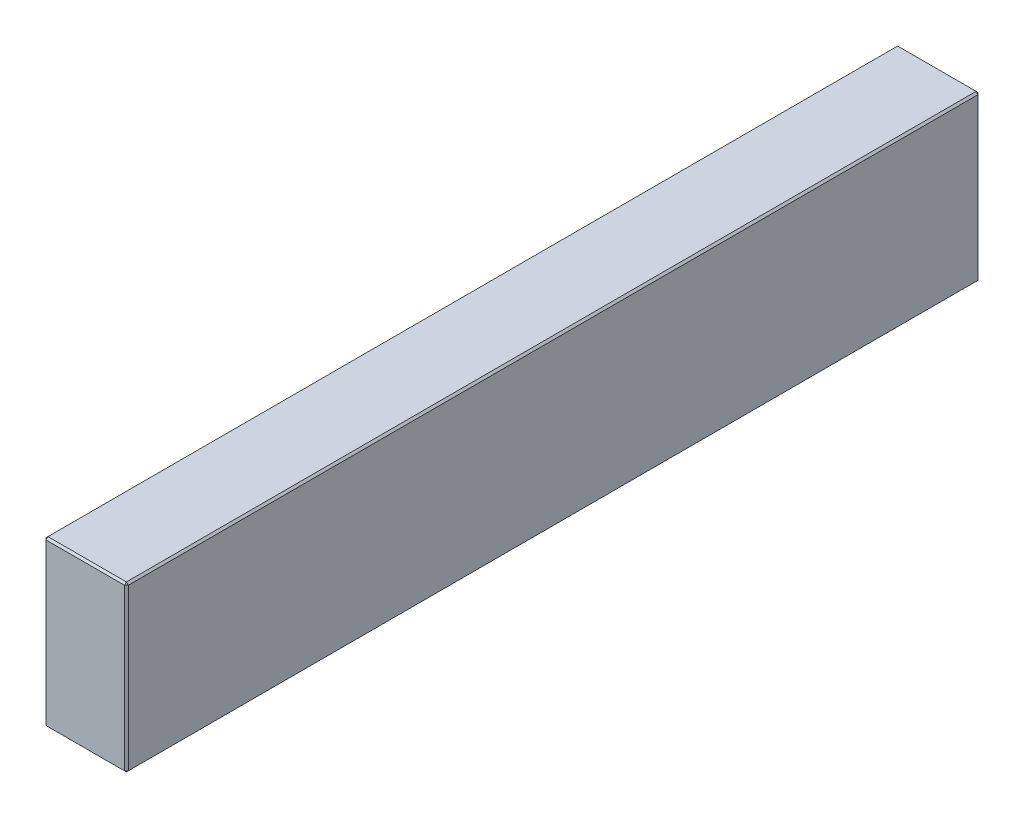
ISO-10303-21;
HEADER;
FILE_DESCRIPTION(('STEP AP214'),'2;1');
FILE_NAME('part.step','',(''),(''),'','','');
FILE_SCHEMA(('AUTOMOTIVE_DESIGN { 1 0 10303 214 1 1 1 1 }'));
ENDSEC;
DATA;
#1=APPLICATION_CONTEXT('core data for automotive mechanical design processes');
#2=APPLICATION_PROTOCOL_DEFINITION('international standard','automotive_design',2000,#1);
#3=PRODUCT_CONTEXT('',#1,'mechanical');
#4=PRODUCT('Part','Part','',(#3));
#5=PRODUCT_RELATED_PRODUCT_CATEGORY('part','',(#4));
#6=PRODUCT_DEFINITION_FORMATION('','',#4);
#7=PRODUCT_DEFINITION_CONTEXT('part definition',#1,'design');
#8=PRODUCT_DEFINITION('design','',#6,#7);
#9=PRODUCT_DEFINITION_SHAPE('','',#8);
#10=(LENGTH_UNIT() NAMED_UNIT(*) SI_UNIT(.MILLI.,.METRE.));
#11=(NAMED_UNIT(*) PLANE_ANGLE_UNIT() SI_UNIT($,.RADIAN.));
#12=(NAMED_UNIT(*) SI_UNIT($,.STERADIAN.) SOLID_ANGLE_UNIT());
#13=UNCERTAINTY_MEASURE_WITH_UNIT(LENGTH_MEASURE(1.E-05),#10,'distance_accuracy_value','');
#14=(GEOMETRIC_REPRESENTATION_CONTEXT(3) GLOBAL_UNCERTAINTY_ASSIGNED_CONTEXT((#13)) GLOBAL_UNIT_ASSIGNED_CONTEXT((#10,
#11,#12)) REPRESENTATION_CONTEXT('',''));
#15=CARTESIAN_POINT('',(0.,0.,0.));
#16=DIRECTION('',(0.,0.,1.));
#17=DIRECTION('',(1.,0.,0.));
#18=AXIS2_PLACEMENT_3D('',#15,#16,#17);
#19=CARTESIAN_POINT('',(-21.5,86.,223.));
#20=DIRECTION('',(1.,0.,0.));
#21=DIRECTION('',(0.,0.,-1.));
#22=AXIS2_PLACEMENT_3D('',#19,#20,#21);
#23=PLANE('',#22);
#24=DIRECTION('',(0.,-1.,0.));
#25=VECTOR('',#24,1.);
#26=CARTESIAN_POINT('',(-21.5,86.,-222.));
#27=LINE('',#26,#25);
#28=CARTESIAN_POINT('',(-21.5,85.,-222.));
#29=VERTEX_POINT('',#28);
#30=CARTESIAN_POINT('',(-21.5,1.,-222.));
#31=VERTEX_POINT('',#30);
#32=EDGE_CURVE('E114',#29,#31,#27,.T.);
#33=ORIENTED_EDGE('',*,*,#32,.T.);
#34=DIRECTION('',(0.,0.,1.));
#35=VECTOR('',#34,1.);
#36=CARTESIAN_POINT('',(-21.5,1.,223.));
#37=LINE('',#36,#35);
#38=CARTESIAN_POINT('',(-21.5,1.,222.));
#39=VERTEX_POINT('',#38);
#40=EDGE_CURVE('E110',#31,#39,#37,.T.);
#41=ORIENTED_EDGE('',*,*,#40,.T.);
#42=DIRECTION('',(0.,1.,0.));
#43=VECTOR('',#42,1.);
#44=CARTESIAN_POINT('',(-21.5,86.,222.));
#45=LINE('',#44,#43);
#46=CARTESIAN_POINT('',(-21.5,85.,222.));
#47=VERTEX_POINT('',#46);
#48=EDGE_CURVE('E103',#39,#47,#45,.T.);
#49=ORIENTED_EDGE('',*,*,#48,.T.);
#50=DIRECTION('',(0.,0.,-1.));
#51=VECTOR('',#50,1.);
#52=CARTESIAN_POINT('',(-21.5,85.,-223.));
#53=LINE('',#52,#51);
#54=EDGE_CURVE('E107',#47,#29,#53,.T.);
#55=ORIENTED_EDGE('',*,*,#54,.T.);
#56=EDGE_LOOP('',(#33,#41,#49,#55));
#57=FACE_BOUND('',#56,.T.);
#58=ADVANCED_FACE('F15',(#57),#23,.F.);
#59=CARTESIAN_POINT('',(21.5,86.,223.));
#60=DIRECTION('',(0.,0.,-1.));
#61=DIRECTION('',(-1.,0.,0.));
#62=AXIS2_PLACEMENT_3D('',#59,#60,#61);
#63=PLANE('',#62);
#64=DIRECTION('',(-1.,0.,0.));
#65=VECTOR('',#64,1.);
#66=CARTESIAN_POINT('',(-21.5,85.,223.));
#67=LINE('',#66,#65);
#68=CARTESIAN_POINT('',(20.5,85.,223.));
#69=VERTEX_POINT('',#68);
#70=CARTESIAN_POINT('',(-20.5,85.,223.));
#71=VERTEX_POINT('',#70);
#72=EDGE_CURVE('E164',#69,#71,#67,.T.);
#73=ORIENTED_EDGE('',*,*,#72,.T.);
#74=DIRECTION('',(0.,-1.,0.));
#75=VECTOR('',#74,1.);
#76=CARTESIAN_POINT('',(-20.5,86.,223.));
#77=LINE('',#76,#75);
#78=CARTESIAN_POINT('',(-20.5,1.,223.));
#79=VERTEX_POINT('',#78);
#80=EDGE_CURVE('E122',#71,#79,#77,.T.);
#81=ORIENTED_EDGE('',*,*,#80,.T.);
#82=DIRECTION('',(1.,0.,0.));
#83=VECTOR('',#82,1.);
#84=CARTESIAN_POINT('',(21.5,1.,223.));
#85=LINE('',#84,#83);
#86=CARTESIAN_POINT('',(20.5,1.,223.));
#87=VERTEX_POINT('',#86);
#88=EDGE_CURVE('E168',#79,#87,#85,.T.);
#89=ORIENTED_EDGE('',*,*,#88,.T.);
#90=DIRECTION('',(0.,1.,0.));
#91=VECTOR('',#90,1.);
#92=CARTESIAN_POINT('',(20.5,86.,223.));
#93=LINE('',#92,#91);
#94=EDGE_CURVE('E166',#87,#69,#93,.T.);
#95=ORIENTED_EDGE('',*,*,#94,.T.);
#96=EDGE_LOOP('',(#73,#81,#89,#95));
#97=FACE_BOUND('',#96,.T.);
#98=ADVANCED_FACE('F275',(#97),#63,.F.);
#99=CARTESIAN_POINT('',(21.5,86.,223.));
#100=DIRECTION('',(-1.,0.,0.));
#101=DIRECTION('',(0.,0.,1.));
#102=AXIS2_PLACEMENT_3D('',#99,#100,#101);
#103=PLANE('',#102);
#104=DIRECTION('',(0.,0.,-1.));
#105=VECTOR('',#104,1.);
#106=CARTESIAN_POINT('',(21.5,1.,223.));
#107=LINE('',#106,#105);
#108=CARTESIAN_POINT('',(21.5,1.,222.));
#109=VERTEX_POINT('',#108);
#110=CARTESIAN_POINT('',(21.5,1.,-222.));
#111=VERTEX_POINT('',#110);
#112=EDGE_CURVE('E159',#109,#111,#107,.T.);
#113=ORIENTED_EDGE('',*,*,#112,.T.);
#114=DIRECTION('',(0.,1.,0.));
#115=VECTOR('',#114,1.);
#116=CARTESIAN_POINT('',(21.5,86.,-222.));
#117=LINE('',#116,#115);
#118=CARTESIAN_POINT('',(21.5,85.,-222.));
#119=VERTEX_POINT('',#118);
#120=EDGE_CURVE('E161',#111,#119,#117,.T.);
#121=ORIENTED_EDGE('',*,*,#120,.T.);
#122=DIRECTION('',(0.,0.,1.));
#123=VECTOR('',#122,1.);
#124=CARTESIAN_POINT('',(21.5,85.,223.));
#125=LINE('',#124,#123);
#126=CARTESIAN_POINT('',(21.5,85.,222.));
#127=VERTEX_POINT('',#126);
#128=EDGE_CURVE('E155',#119,#127,#125,.T.);
#129=ORIENTED_EDGE('',*,*,#128,.T.);
#130=DIRECTION('',(0.,-1.,0.));
#131=VECTOR('',#130,1.);
#132=CARTESIAN_POINT('',(21.5,86.,222.));
#133=LINE('',#132,#131);
#134=EDGE_CURVE('E157',#127,#109,#133,.T.);
#135=ORIENTED_EDGE('',*,*,#134,.T.);
#136=EDGE_LOOP('',(#113,#121,#129,#135));
#137=FACE_BOUND('',#136,.T.);
#138=ADVANCED_FACE('F254',(#137),#103,.F.);
#139=CARTESIAN_POINT('',(21.5,86.,-223.));
#140=DIRECTION('',(0.,0.,1.));
#141=DIRECTION('',(1.,0.,0.));
#142=AXIS2_PLACEMENT_3D('',#139,#140,#141);
#143=PLANE('',#142);
#144=DIRECTION('',(0.,-1.,0.));
#145=VECTOR('',#144,1.);
#146=CARTESIAN_POINT('',(20.5,86.,-223.));
#147=LINE('',#146,#145);
#148=CARTESIAN_POINT('',(20.5,85.,-223.));
#149=VERTEX_POINT('',#148);
#150=CARTESIAN_POINT('',(20.5,1.,-223.));
#151=VERTEX_POINT('',#150);
#152=EDGE_CURVE('E148',#149,#151,#147,.T.);
#153=ORIENTED_EDGE('',*,*,#152,.T.);
#154=DIRECTION('',(-1.,0.,0.));
#155=VECTOR('',#154,1.);
#156=CARTESIAN_POINT('',(21.5,1.,-223.));
#157=LINE('',#156,#155);
#158=CARTESIAN_POINT('',(-20.5,1.,-223.));
#159=VERTEX_POINT('',#158);
#160=EDGE_CURVE('E153',#151,#159,#157,.T.);
#161=ORIENTED_EDGE('',*,*,#160,.T.);
#162=DIRECTION('',(0.,1.,0.));
#163=VECTOR('',#162,1.);
#164=CARTESIAN_POINT('',(-20.5,86.,-223.));
#165=LINE('',#164,#163);
#166=CARTESIAN_POINT('',(-20.5,85.,-223.));
#167=VERTEX_POINT('',#166);
#168=EDGE_CURVE('E150',#159,#167,#165,.T.);
#169=ORIENTED_EDGE('',*,*,#168,.T.);
#170=DIRECTION('',(1.,0.,0.));
#171=VECTOR('',#170,1.);
#172=CARTESIAN_POINT('',(21.5,85.,-223.));
#173=LINE('',#172,#171);
#174=EDGE_CURVE('E146',#167,#149,#173,.T.);
#175=ORIENTED_EDGE('',*,*,#174,.T.);
#176=EDGE_LOOP('',(#153,#161,#169,#175));
#177=FACE_BOUND('',#176,.T.);
#178=ADVANCED_FACE('F284',(#177),#143,.F.);
#179=CARTESIAN_POINT('',(0.,86.,0.));
#180=DIRECTION('',(0.,1.,0.));
#181=DIRECTION('',(0.,0.,1.));
#182=AXIS2_PLACEMENT_3D('',#179,#180,#181);
#183=PLANE('',#182);
#184=DIRECTION('',(0.,0.,-1.));
#185=VECTOR('',#184,1.);
#186=CARTESIAN_POINT('',(20.5,86.,-223.));
#187=LINE('',#186,#185);
#188=CARTESIAN_POINT('',(20.5,86.,222.));
#189=VERTEX_POINT('',#188);
#190=CARTESIAN_POINT('',(20.5,86.,-222.));
#191=VERTEX_POINT('',#190);
#192=EDGE_CURVE('E24',#189,#191,#187,.T.);
#193=ORIENTED_EDGE('',*,*,#192,.T.);
#194=DIRECTION('',(-1.,0.,0.));
#195=VECTOR('',#194,1.);
#196=CARTESIAN_POINT('',(-21.5,86.,-222.));
#197=LINE('',#196,#195);
#198=CARTESIAN_POINT('',(-20.5,86.,-222.));
#199=VERTEX_POINT('',#198);
#200=EDGE_CURVE('E9',#191,#199,#197,.T.);
#201=ORIENTED_EDGE('',*,*,#200,.T.);
#202=DIRECTION('',(0.,0.,1.));
#203=VECTOR('',#202,1.);
#204=CARTESIAN_POINT('',(-20.5,86.,223.));
#205=LINE('',#204,#203);
#206=CARTESIAN_POINT('',(-20.5,86.,222.));
#207=VERTEX_POINT('',#206);
#208=EDGE_CURVE('E180',#199,#207,#205,.T.);
#209=ORIENTED_EDGE('',*,*,#208,.T.);
#210=DIRECTION('',(1.,0.,0.));
#211=VECTOR('',#210,1.);
#212=CARTESIAN_POINT('',(21.5,86.,222.));
#213=LINE('',#212,#211);
#214=EDGE_CURVE('E35',#207,#189,#213,.T.);
#215=ORIENTED_EDGE('',*,*,#214,.T.);
#216=EDGE_LOOP('',(#193,#201,#209,#215));
#217=FACE_BOUND('',#216,.T.);
#218=ADVANCED_FACE('F350',(#217),#183,.T.);
#219=CARTESIAN_POINT('',(0.,0.,0.));
#220=DIRECTION('',(0.,1.,0.));
#221=DIRECTION('',(0.,0.,1.));
#222=AXIS2_PLACEMENT_3D('',#219,#220,#221);
#223=PLANE('',#222);
#224=DIRECTION('',(0.,0.,1.));
#225=VECTOR('',#224,1.);
#226=CARTESIAN_POINT('',(20.5,0.,0.));
#227=LINE('',#226,#225);
#228=CARTESIAN_POINT('',(20.5,0.,-222.));
#229=VERTEX_POINT('',#228);
#230=CARTESIAN_POINT('',(20.5,0.,222.));
#231=VERTEX_POINT('',#230);
#232=EDGE_CURVE('E171',#229,#231,#227,.T.);
#233=ORIENTED_EDGE('',*,*,#232,.T.);
#234=DIRECTION('',(-1.,0.,0.));
#235=VECTOR('',#234,1.);
#236=CARTESIAN_POINT('',(0.,0.,222.));
#237=LINE('',#236,#235);
#238=CARTESIAN_POINT('',(-20.5,0.,222.));
#239=VERTEX_POINT('',#238);
#240=EDGE_CURVE('E177',#231,#239,#237,.T.);
#241=ORIENTED_EDGE('',*,*,#240,.T.);
#242=DIRECTION('',(0.,0.,-1.));
#243=VECTOR('',#242,1.);
#244=CARTESIAN_POINT('',(-20.5,0.,0.));
#245=LINE('',#244,#243);
#246=CARTESIAN_POINT('',(-20.5,0.,-222.));
#247=VERTEX_POINT('',#246);
#248=EDGE_CURVE('E175',#239,#247,#245,.T.);
#249=ORIENTED_EDGE('',*,*,#248,.T.);
#250=DIRECTION('',(1.,0.,0.));
#251=VECTOR('',#250,1.);
#252=CARTESIAN_POINT('',(0.,0.,-222.));
#253=LINE('',#252,#251);
#254=EDGE_CURVE('E173',#247,#229,#253,.T.);
#255=ORIENTED_EDGE('',*,*,#254,.T.);
#256=EDGE_LOOP('',(#233,#241,#249,#255));
#257=FACE_BOUND('',#256,.T.);
#258=ADVANCED_FACE('F246',(#257),#223,.F.);
#259=CARTESIAN_POINT('',(21.5,86.,222.));
#260=DIRECTION('',(-0.707106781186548,0.,-0.707106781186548));
#261=DIRECTION('',(0.,-1.,0.));
#262=AXIS2_PLACEMENT_3D('',#259,#260,#261);
#263=PLANE('',#262);
#264=DIRECTION('',(-0.707106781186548,0.,0.707106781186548));
#265=VECTOR('',#264,1.);
#266=CARTESIAN_POINT('',(20.5,85.,223.));
#267=LINE('',#266,#265);
#268=EDGE_CURVE('E19',#69,#127,#267,.F.);
#269=ORIENTED_EDGE('',*,*,#268,.F.);
#270=ORIENTED_EDGE('',*,*,#94,.F.);
#271=DIRECTION('',(0.707106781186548,0.,-0.707106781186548));
#272=VECTOR('',#271,1.);
#273=CARTESIAN_POINT('',(20.5,1.,223.));
#274=LINE('',#273,#272);
#275=EDGE_CURVE('E142',#109,#87,#274,.F.);
#276=ORIENTED_EDGE('',*,*,#275,.F.);
#277=ORIENTED_EDGE('',*,*,#134,.F.);
#278=EDGE_LOOP('',(#269,#270,#276,#277));
#279=FACE_BOUND('',#278,.T.);
#280=ADVANCED_FACE('F17',(#279),#263,.F.);
#281=CARTESIAN_POINT('',(20.5,85.,223.));
#282=DIRECTION('',(0.577350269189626,0.577350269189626,0.577350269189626));
#283=DIRECTION('',(0.707106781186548,0.,-0.707106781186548));
#284=AXIS2_PLACEMENT_3D('',#281,#282,#283);
#285=PLANE('',#284);
#286=DIRECTION('',(0.,-0.707106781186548,0.707106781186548));
#287=VECTOR('',#286,1.);
#288=CARTESIAN_POINT('',(20.5,85.,223.));
#289=LINE('',#288,#287);
#290=EDGE_CURVE('E226',#69,#189,#289,.F.);
#291=ORIENTED_EDGE('',*,*,#290,.F.);
#292=ORIENTED_EDGE('',*,*,#268,.T.);
#293=DIRECTION('',(-0.707106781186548,0.707106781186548,0.));
#294=VECTOR('',#293,1.);
#295=CARTESIAN_POINT('',(21.,85.5,222.));
#296=LINE('',#295,#294);
#297=EDGE_CURVE('E228',#189,#127,#296,.F.);
#298=ORIENTED_EDGE('',*,*,#297,.F.);
#299=EDGE_LOOP('',(#291,#292,#298));
#300=FACE_BOUND('',#299,.T.);
#301=ADVANCED_FACE('F270',(#300),#285,.T.);
#302=CARTESIAN_POINT('',(20.5,1.,223.));
#303=DIRECTION('',(0.577350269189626,-0.577350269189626,0.577350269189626));
#304=DIRECTION('',(0.707106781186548,0.,-0.707106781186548));
#305=AXIS2_PLACEMENT_3D('',#302,#303,#304);
#306=PLANE('',#305);
#307=DIRECTION('',(-0.707106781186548,-0.707106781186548,0.));
#308=VECTOR('',#307,1.);
#309=CARTESIAN_POINT('',(21.,0.5,222.));
#310=LINE('',#309,#308);
#311=EDGE_CURVE('E220',#109,#231,#310,.T.);
#312=ORIENTED_EDGE('',*,*,#311,.F.);
#313=ORIENTED_EDGE('',*,*,#275,.T.);
#314=DIRECTION('',(0.,0.707106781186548,0.707106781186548));
#315=VECTOR('',#314,1.);
#316=CARTESIAN_POINT('',(20.5,1.,223.));
#317=LINE('',#316,#315);
#318=EDGE_CURVE('E223',#231,#87,#317,.T.);
#319=ORIENTED_EDGE('',*,*,#318,.F.);
#320=EDGE_LOOP('',(#312,#313,#319));
#321=FACE_BOUND('',#320,.T.);
#322=ADVANCED_FACE('F235',(#321),#306,.T.);
#323=CARTESIAN_POINT('',(20.5,86.,0.));
#324=DIRECTION('',(0.707106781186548,0.707106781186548,0.));
#325=DIRECTION('',(0.,0.,1.));
#326=AXIS2_PLACEMENT_3D('',#323,#324,#325);
#327=PLANE('',#326);
#328=ORIENTED_EDGE('',*,*,#297,.T.);
#329=ORIENTED_EDGE('',*,*,#128,.F.);
#330=DIRECTION('',(0.707106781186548,-0.707106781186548,0.));
#331=VECTOR('',#330,1.);
#332=CARTESIAN_POINT('',(21.5,85.,-222.));
#333=LINE('',#332,#331);
#334=EDGE_CURVE('E215',#191,#119,#333,.T.);
#335=ORIENTED_EDGE('',*,*,#334,.F.);
#336=ORIENTED_EDGE('',*,*,#192,.F.);
#337=EDGE_LOOP('',(#328,#329,#335,#336));
#338=FACE_BOUND('',#337,.T.);
#339=ADVANCED_FACE('F265',(#338),#327,.T.);
#340=CARTESIAN_POINT('',(0.,86.,222.));
#341=DIRECTION('',(0.,0.707106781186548,0.707106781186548));
#342=DIRECTION('',(-1.,0.,0.));
#343=AXIS2_PLACEMENT_3D('',#340,#341,#342);
#344=PLANE('',#343);
#345=ORIENTED_EDGE('',*,*,#290,.T.);
#346=ORIENTED_EDGE('',*,*,#214,.F.);
#347=DIRECTION('',(0.,0.707106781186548,-0.707106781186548));
#348=VECTOR('',#347,1.);
#349=CARTESIAN_POINT('',(-20.5,85.5,222.5));
#350=LINE('',#349,#348);
#351=EDGE_CURVE('E126',#71,#207,#350,.T.);
#352=ORIENTED_EDGE('',*,*,#351,.F.);
#353=ORIENTED_EDGE('',*,*,#72,.F.);
#354=EDGE_LOOP('',(#345,#346,#352,#353));
#355=FACE_BOUND('',#354,.T.);
#356=ADVANCED_FACE('F273',(#355),#344,.T.);
#357=CARTESIAN_POINT('',(-20.5,86.,223.));
#358=DIRECTION('',(0.707106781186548,0.,-0.707106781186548));
#359=DIRECTION('',(0.,-1.,0.));
#360=AXIS2_PLACEMENT_3D('',#357,#358,#359);
#361=PLANE('',#360);
#362=DIRECTION('',(0.707106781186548,0.,0.707106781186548));
#363=VECTOR('',#362,1.);
#364=CARTESIAN_POINT('',(-20.5,1.,223.));
#365=LINE('',#364,#363);
#366=EDGE_CURVE('E127',#79,#39,#365,.F.);
#367=ORIENTED_EDGE('',*,*,#366,.F.);
#368=ORIENTED_EDGE('',*,*,#80,.F.);
#369=DIRECTION('',(-0.707106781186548,0.,-0.707106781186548));
#370=VECTOR('',#369,1.);
#371=CARTESIAN_POINT('',(-21.5,85.,222.));
#372=LINE('',#371,#370);
#373=EDGE_CURVE('E118',#47,#71,#372,.F.);
#374=ORIENTED_EDGE('',*,*,#373,.F.);
#375=ORIENTED_EDGE('',*,*,#48,.F.);
#376=EDGE_LOOP('',(#367,#368,#374,#375));
#377=FACE_BOUND('',#376,.T.);
#378=ADVANCED_FACE('F120',(#377),#361,.F.);
#379=CARTESIAN_POINT('',(21.5,1.,223.));
#380=DIRECTION('',(0.,0.707106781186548,-0.707106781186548));
#381=DIRECTION('',(1.,0.,0.));
#382=AXIS2_PLACEMENT_3D('',#379,#380,#381);
#383=PLANE('',#382);
#384=ORIENTED_EDGE('',*,*,#318,.T.);
#385=ORIENTED_EDGE('',*,*,#88,.F.);
#386=DIRECTION('',(0.,-0.707106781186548,-0.707106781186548));
#387=VECTOR('',#386,1.);
#388=CARTESIAN_POINT('',(-20.5,1.,223.));
#389=LINE('',#388,#387);
#390=EDGE_CURVE('E211',#239,#79,#389,.F.);
#391=ORIENTED_EDGE('',*,*,#390,.F.);
#392=ORIENTED_EDGE('',*,*,#240,.F.);
#393=EDGE_LOOP('',(#384,#385,#391,#392));
#394=FACE_BOUND('',#393,.T.);
#395=ADVANCED_FACE('F243',(#394),#383,.F.);
#396=CARTESIAN_POINT('',(21.5,1.,223.));
#397=DIRECTION('',(-0.707106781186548,0.707106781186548,0.));
#398=DIRECTION('',(0.,0.,-1.));
#399=AXIS2_PLACEMENT_3D('',#396,#397,#398);
#400=PLANE('',#399);
#401=ORIENTED_EDGE('',*,*,#311,.T.);
#402=ORIENTED_EDGE('',*,*,#232,.F.);
#403=DIRECTION('',(0.707106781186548,0.707106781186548,0.));
#404=VECTOR('',#403,1.);
#405=CARTESIAN_POINT('',(21.,0.5,-222.));
#406=LINE('',#405,#404);
#407=EDGE_CURVE('E208',#111,#229,#406,.F.);
#408=ORIENTED_EDGE('',*,*,#407,.F.);
#409=ORIENTED_EDGE('',*,*,#112,.F.);
#410=EDGE_LOOP('',(#401,#402,#408,#409));
#411=FACE_BOUND('',#410,.T.);
#412=ADVANCED_FACE('F251',(#411),#400,.F.);
#413=CARTESIAN_POINT('',(20.5,86.,-223.));
#414=DIRECTION('',(-0.707106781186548,0.,0.707106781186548));
#415=DIRECTION('',(0.,-1.,0.));
#416=AXIS2_PLACEMENT_3D('',#413,#414,#415);
#417=PLANE('',#416);
#418=DIRECTION('',(0.707106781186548,0.,0.707106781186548));
#419=VECTOR('',#418,1.);
#420=CARTESIAN_POINT('',(21.5,85.,-222.));
#421=LINE('',#420,#419);
#422=EDGE_CURVE('E217',#119,#149,#421,.F.);
#423=ORIENTED_EDGE('',*,*,#422,.F.);
#424=ORIENTED_EDGE('',*,*,#120,.F.);
#425=DIRECTION('',(-0.707106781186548,0.,-0.707106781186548));
#426=VECTOR('',#425,1.);
#427=CARTESIAN_POINT('',(20.5,1.,-223.));
#428=LINE('',#427,#426);
#429=EDGE_CURVE('E205',#151,#111,#428,.F.);
#430=ORIENTED_EDGE('',*,*,#429,.F.);
#431=ORIENTED_EDGE('',*,*,#152,.F.);
#432=EDGE_LOOP('',(#423,#424,#430,#431));
#433=FACE_BOUND('',#432,.T.);
#434=ADVANCED_FACE('F258',(#433),#417,.F.);
#435=CARTESIAN_POINT('',(21.5,85.,-222.));
#436=DIRECTION('',(0.577350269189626,0.577350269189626,-0.577350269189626));
#437=DIRECTION('',(-0.707106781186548,0.,-0.707106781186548));
#438=AXIS2_PLACEMENT_3D('',#435,#436,#437);
#439=PLANE('',#438);
#440=ORIENTED_EDGE('',*,*,#334,.T.);
#441=ORIENTED_EDGE('',*,*,#422,.T.);
#442=DIRECTION('',(0.,0.707106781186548,0.707106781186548));
#443=VECTOR('',#442,1.);
#444=CARTESIAN_POINT('',(20.5,85.5,-222.5));
#445=LINE('',#444,#443);
#446=EDGE_CURVE('E134',#191,#149,#445,.F.);
#447=ORIENTED_EDGE('',*,*,#446,.F.);
#448=EDGE_LOOP('',(#440,#441,#447));
#449=FACE_BOUND('',#448,.T.);
#450=ADVANCED_FACE('F325',(#449),#439,.T.);
#451=CARTESIAN_POINT('',(-21.5,85.,222.));
#452=DIRECTION('',(-0.577350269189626,0.577350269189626,0.577350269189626));
#453=DIRECTION('',(0.707106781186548,0.,0.707106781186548));
#454=AXIS2_PLACEMENT_3D('',#451,#452,#453);
#455=PLANE('',#454);
#456=ORIENTED_EDGE('',*,*,#373,.T.);
#457=ORIENTED_EDGE('',*,*,#351,.T.);
#458=DIRECTION('',(-0.707106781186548,-0.707106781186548,0.));
#459=VECTOR('',#458,1.);
#460=CARTESIAN_POINT('',(-21.5,85.,222.));
#461=LINE('',#460,#459);
#462=EDGE_CURVE('E130',#47,#207,#461,.F.);
#463=ORIENTED_EDGE('',*,*,#462,.F.);
#464=EDGE_LOOP('',(#456,#457,#463));
#465=FACE_BOUND('',#464,.T.);
#466=ADVANCED_FACE('F131',(#465),#455,.T.);
#467=CARTESIAN_POINT('',(-20.5,1.,223.));
#468=DIRECTION('',(-0.577350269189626,-0.577350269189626,0.577350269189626));
#469=DIRECTION('',(0.707106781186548,0.,0.707106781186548));
#470=AXIS2_PLACEMENT_3D('',#467,#468,#469);
#471=PLANE('',#470);
#472=ORIENTED_EDGE('',*,*,#390,.T.);
#473=ORIENTED_EDGE('',*,*,#366,.T.);
#474=DIRECTION('',(-0.707106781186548,0.707106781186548,0.));
#475=VECTOR('',#474,1.);
#476=CARTESIAN_POINT('',(-21.,0.5,222.));
#477=LINE('',#476,#475);
#478=EDGE_CURVE('E135',#239,#39,#477,.T.);
#479=ORIENTED_EDGE('',*,*,#478,.F.);
#480=EDGE_LOOP('',(#472,#473,#479));
#481=FACE_BOUND('',#480,.T.);
#482=ADVANCED_FACE('F318',(#481),#471,.T.);
#483=CARTESIAN_POINT('',(20.5,1.,-223.));
#484=DIRECTION('',(0.577350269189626,-0.577350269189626,-0.577350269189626));
#485=DIRECTION('',(-0.707106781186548,0.,-0.707106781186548));
#486=AXIS2_PLACEMENT_3D('',#483,#484,#485);
#487=PLANE('',#486);
#488=ORIENTED_EDGE('',*,*,#429,.T.);
#489=ORIENTED_EDGE('',*,*,#407,.T.);
#490=DIRECTION('',(0.,-0.707106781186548,0.707106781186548));
#491=VECTOR('',#490,1.);
#492=CARTESIAN_POINT('',(20.5,1.,-223.));
#493=LINE('',#492,#491);
#494=EDGE_CURVE('E198',#151,#229,#493,.T.);
#495=ORIENTED_EDGE('',*,*,#494,.F.);
#496=EDGE_LOOP('',(#488,#489,#495));
#497=FACE_BOUND('',#496,.T.);
#498=ADVANCED_FACE('F314',(#497),#487,.T.);
#499=CARTESIAN_POINT('',(0.,86.,-222.));
#500=DIRECTION('',(0.,0.707106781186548,-0.707106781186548));
#501=DIRECTION('',(1.,0.,0.));
#502=AXIS2_PLACEMENT_3D('',#499,#500,#501);
#503=PLANE('',#502);
#504=ORIENTED_EDGE('',*,*,#446,.T.);
#505=ORIENTED_EDGE('',*,*,#174,.F.);
#506=DIRECTION('',(0.,-0.707106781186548,-0.707106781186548));
#507=VECTOR('',#506,1.);
#508=CARTESIAN_POINT('',(-20.5,85.,-223.));
#509=LINE('',#508,#507);
#510=EDGE_CURVE('E195',#199,#167,#509,.T.);
#511=ORIENTED_EDGE('',*,*,#510,.F.);
#512=ORIENTED_EDGE('',*,*,#200,.F.);
#513=EDGE_LOOP('',(#504,#505,#511,#512));
#514=FACE_BOUND('',#513,.T.);
#515=ADVANCED_FACE('F311',(#514),#503,.T.);
#516=CARTESIAN_POINT('',(-20.5,86.,0.));
#517=DIRECTION('',(-0.707106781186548,0.707106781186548,0.));
#518=DIRECTION('',(0.,0.,-1.));
#519=AXIS2_PLACEMENT_3D('',#516,#517,#518);
#520=PLANE('',#519);
#521=ORIENTED_EDGE('',*,*,#462,.T.);
#522=ORIENTED_EDGE('',*,*,#208,.F.);
#523=DIRECTION('',(0.707106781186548,0.707106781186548,0.));
#524=VECTOR('',#523,1.);
#525=CARTESIAN_POINT('',(-21.,85.5,-222.));
#526=LINE('',#525,#524);
#527=EDGE_CURVE('E138',#29,#199,#526,.T.);
#528=ORIENTED_EDGE('',*,*,#527,.F.);
#529=ORIENTED_EDGE('',*,*,#54,.F.);
#530=EDGE_LOOP('',(#521,#522,#528,#529));
#531=FACE_BOUND('',#530,.T.);
#532=ADVANCED_FACE('F137',(#531),#520,.T.);
#533=CARTESIAN_POINT('',(-21.5,1.,223.));
#534=DIRECTION('',(0.707106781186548,0.707106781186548,0.));
#535=DIRECTION('',(0.,0.,1.));
#536=AXIS2_PLACEMENT_3D('',#533,#534,#535);
#537=PLANE('',#536);
#538=ORIENTED_EDGE('',*,*,#478,.T.);
#539=ORIENTED_EDGE('',*,*,#40,.F.);
#540=DIRECTION('',(0.707106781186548,-0.707106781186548,0.));
#541=VECTOR('',#540,1.);
#542=CARTESIAN_POINT('',(-21.5,1.,-222.));
#543=LINE('',#542,#541);
#544=EDGE_CURVE('E191',#247,#31,#543,.F.);
#545=ORIENTED_EDGE('',*,*,#544,.F.);
#546=ORIENTED_EDGE('',*,*,#248,.F.);
#547=EDGE_LOOP('',(#538,#539,#545,#546));
#548=FACE_BOUND('',#547,.T.);
#549=ADVANCED_FACE('F304',(#548),#537,.F.);
#550=CARTESIAN_POINT('',(21.5,1.,-223.));
#551=DIRECTION('',(0.,0.707106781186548,0.707106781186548));
#552=DIRECTION('',(-1.,0.,0.));
#553=AXIS2_PLACEMENT_3D('',#550,#551,#552);
#554=PLANE('',#553);
#555=ORIENTED_EDGE('',*,*,#494,.T.);
#556=ORIENTED_EDGE('',*,*,#254,.F.);
#557=DIRECTION('',(0.,0.707106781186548,-0.707106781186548));
#558=VECTOR('',#557,1.);
#559=CARTESIAN_POINT('',(-20.5,0.5,-222.5));
#560=LINE('',#559,#558);
#561=EDGE_CURVE('E188',#159,#247,#560,.F.);
#562=ORIENTED_EDGE('',*,*,#561,.F.);
#563=ORIENTED_EDGE('',*,*,#160,.F.);
#564=EDGE_LOOP('',(#555,#556,#562,#563));
#565=FACE_BOUND('',#564,.T.);
#566=ADVANCED_FACE('F300',(#565),#554,.F.);
#567=CARTESIAN_POINT('',(-20.5,85.,-223.));
#568=DIRECTION('',(-0.577350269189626,0.577350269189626,-0.577350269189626));
#569=DIRECTION('',(-0.707106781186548,0.,0.707106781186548));
#570=AXIS2_PLACEMENT_3D('',#567,#568,#569);
#571=PLANE('',#570);
#572=ORIENTED_EDGE('',*,*,#527,.T.);
#573=ORIENTED_EDGE('',*,*,#510,.T.);
#574=DIRECTION('',(0.707106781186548,0.,-0.707106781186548));
#575=VECTOR('',#574,1.);
#576=CARTESIAN_POINT('',(-20.5,85.,-223.));
#577=LINE('',#576,#575);
#578=EDGE_CURVE('E186',#29,#167,#577,.T.);
#579=ORIENTED_EDGE('',*,*,#578,.F.);
#580=EDGE_LOOP('',(#572,#573,#579));
#581=FACE_BOUND('',#580,.T.);
#582=ADVANCED_FACE('F296',(#581),#571,.T.);
#583=CARTESIAN_POINT('',(-21.5,1.,-222.));
#584=DIRECTION('',(-0.577350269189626,-0.577350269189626,-0.577350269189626));
#585=DIRECTION('',(-0.707106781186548,0.,0.707106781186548));
#586=AXIS2_PLACEMENT_3D('',#583,#584,#585);
#587=PLANE('',#586);
#588=ORIENTED_EDGE('',*,*,#561,.T.);
#589=ORIENTED_EDGE('',*,*,#544,.T.);
#590=DIRECTION('',(-0.707106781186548,0.,0.707106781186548));
#591=VECTOR('',#590,1.);
#592=CARTESIAN_POINT('',(-21.5,1.,-222.));
#593=LINE('',#592,#591);
#594=EDGE_CURVE('E184',#159,#31,#593,.T.);
#595=ORIENTED_EDGE('',*,*,#594,.F.);
#596=EDGE_LOOP('',(#588,#589,#595));
#597=FACE_BOUND('',#596,.T.);
#598=ADVANCED_FACE('F292',(#597),#587,.T.);
#599=CARTESIAN_POINT('',(-21.5,86.,-222.));
#600=DIRECTION('',(0.707106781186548,0.,0.707106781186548));
#601=DIRECTION('',(0.,-1.,0.));
#602=AXIS2_PLACEMENT_3D('',#599,#600,#601);
#603=PLANE('',#602);
#604=ORIENTED_EDGE('',*,*,#578,.T.);
#605=ORIENTED_EDGE('',*,*,#168,.F.);
#606=ORIENTED_EDGE('',*,*,#594,.T.);
#607=ORIENTED_EDGE('',*,*,#32,.F.);
#608=EDGE_LOOP('',(#604,#605,#606,#607));
#609=FACE_BOUND('',#608,.T.);
#610=ADVANCED_FACE('F289',(#609),#603,.F.);
#611=CLOSED_SHELL('',(#58,#98,#138,#178,#218,#258,#280,#301,#322,#339,#356,#378,#395,#412,#434,
#450,#466,#482,#498,#515,#532,#549,#566,#582,#598,#610));
#612=MANIFOLD_SOLID_BREP('B1',#611);
#613=ADVANCED_BREP_SHAPE_REPRESENTATION('',(#18,#612),#14);
#614=SHAPE_DEFINITION_REPRESENTATION(#9,#613);
ENDSEC;
END-ISO-10303-21;
